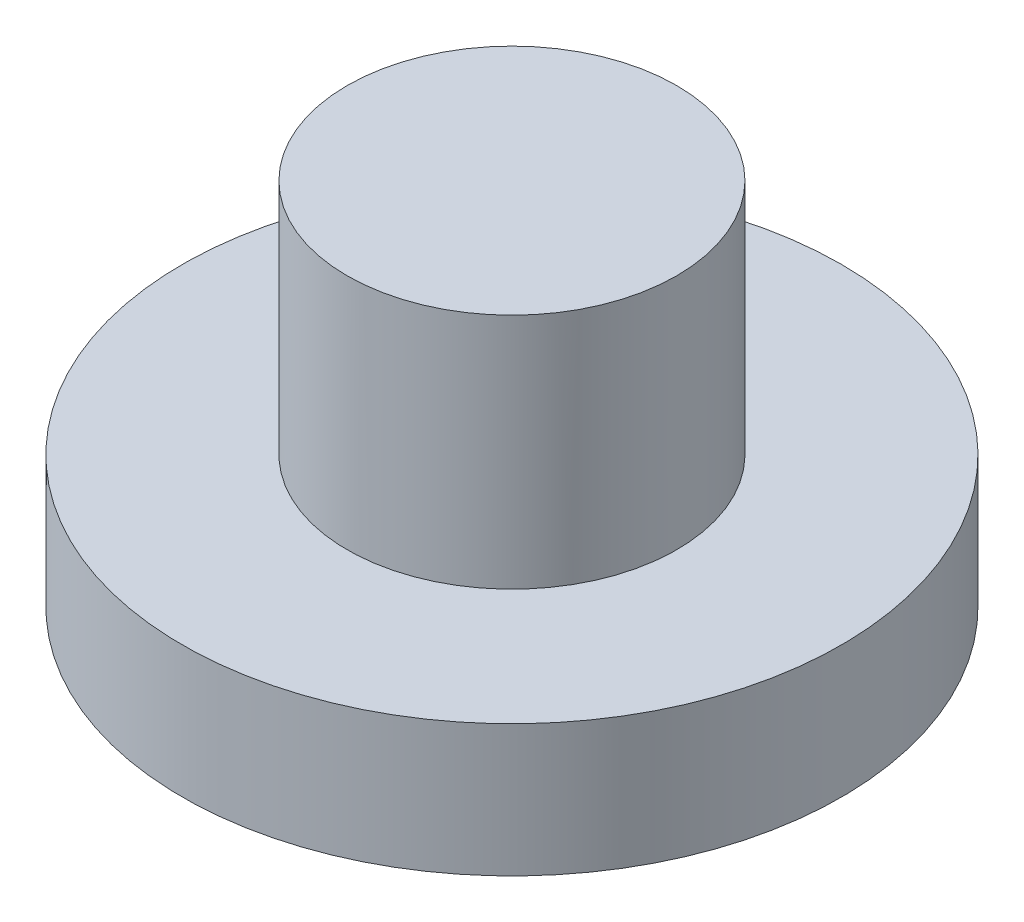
ISO-10303-21;
HEADER;
FILE_DESCRIPTION(('STEP AP214'),'2;1');
FILE_NAME('part.step','',(''),(''),'','','');
FILE_SCHEMA(('AUTOMOTIVE_DESIGN { 1 0 10303 214 1 1 1 1 }'));
ENDSEC;
DATA;
#1=APPLICATION_CONTEXT('core data for automotive mechanical design processes');
#2=APPLICATION_PROTOCOL_DEFINITION('international standard','automotive_design',2000,#1);
#3=PRODUCT_CONTEXT('',#1,'mechanical');
#4=PRODUCT('Part','Part','',(#3));
#5=PRODUCT_RELATED_PRODUCT_CATEGORY('part','',(#4));
#6=PRODUCT_DEFINITION_FORMATION('','',#4);
#7=PRODUCT_DEFINITION_CONTEXT('part definition',#1,'design');
#8=PRODUCT_DEFINITION('design','',#6,#7);
#9=PRODUCT_DEFINITION_SHAPE('','',#8);
#10=(LENGTH_UNIT() NAMED_UNIT(*) SI_UNIT(.MILLI.,.METRE.));
#11=(NAMED_UNIT(*) PLANE_ANGLE_UNIT() SI_UNIT($,.RADIAN.));
#12=(NAMED_UNIT(*) SI_UNIT($,.STERADIAN.) SOLID_ANGLE_UNIT());
#13=UNCERTAINTY_MEASURE_WITH_UNIT(LENGTH_MEASURE(1.E-05),#10,'distance_accuracy_value','');
#14=(GEOMETRIC_REPRESENTATION_CONTEXT(3) GLOBAL_UNCERTAINTY_ASSIGNED_CONTEXT((#13)) GLOBAL_UNIT_ASSIGNED_CONTEXT((#10,
#11,#12)) REPRESENTATION_CONTEXT('',''));
#15=CARTESIAN_POINT('',(0.,0.,0.));
#16=DIRECTION('',(0.,0.,1.));
#17=DIRECTION('',(1.,0.,0.));
#18=AXIS2_PLACEMENT_3D('',#15,#16,#17);
#19=CARTESIAN_POINT('',(0.,1.143,0.));
#20=DIRECTION('',(0.,-1.,0.));
#21=DIRECTION('',(0.,0.,-1.));
#22=AXIS2_PLACEMENT_3D('',#19,#20,#21);
#23=CYLINDRICAL_SURFACE('',#22,0.79375);
#24=CARTESIAN_POINT('',(0.,1.143,0.));
#25=DIRECTION('',(0.,1.,0.));
#26=DIRECTION('',(0.,0.,1.));
#27=AXIS2_PLACEMENT_3D('',#24,#25,#26);
#28=CIRCLE('',#27,0.79375);
#29=CARTESIAN_POINT('',(0.,1.143,0.79375));
#30=VERTEX_POINT('',#29);
#31=EDGE_CURVE('E10',#30,#30,#28,.T.);
#32=ORIENTED_EDGE('',*,*,#31,.F.);
#33=EDGE_LOOP('',(#32));
#34=FACE_BOUND('',#33,.T.);
#35=CARTESIAN_POINT('',(0.,0.,0.));
#36=DIRECTION('',(0.,-1.,0.));
#37=DIRECTION('',(0.,0.,-1.));
#38=AXIS2_PLACEMENT_3D('',#35,#36,#37);
#39=CIRCLE('',#38,0.79375);
#40=CARTESIAN_POINT('',(0.,0.,-0.79375));
#41=VERTEX_POINT('',#40);
#42=EDGE_CURVE('E39',#41,#41,#39,.T.);
#43=ORIENTED_EDGE('',*,*,#42,.F.);
#44=EDGE_LOOP('',(#43));
#45=FACE_BOUND('',#44,.T.);
#46=ADVANCED_FACE('F33',(#34,#45),#23,.T.);
#47=CARTESIAN_POINT('',(0.,1.143,0.));
#48=DIRECTION('',(0.,1.,0.));
#49=DIRECTION('',(0.,0.,1.));
#50=AXIS2_PLACEMENT_3D('',#47,#48,#49);
#51=PLANE('',#50);
#52=ORIENTED_EDGE('',*,*,#31,.T.);
#53=EDGE_LOOP('',(#52));
#54=FACE_BOUND('',#53,.T.);
#55=ADVANCED_FACE('F57',(#54),#51,.T.);
#56=CARTESIAN_POINT('',(0.,0.,0.));
#57=DIRECTION('',(0.,-1.,0.));
#58=DIRECTION('',(0.,0.,-1.));
#59=AXIS2_PLACEMENT_3D('',#56,#57,#58);
#60=PLANE('',#59);
#61=CARTESIAN_POINT('',(0.,0.,0.));
#62=DIRECTION('',(0.,-1.,0.));
#63=DIRECTION('',(0.,0.,-1.));
#64=AXIS2_PLACEMENT_3D('',#61,#62,#63);
#65=CIRCLE('',#64,1.5875);
#66=CARTESIAN_POINT('',(0.,0.,-1.5875));
#67=VERTEX_POINT('',#66);
#68=EDGE_CURVE('E47',#67,#67,#65,.T.);
#69=ORIENTED_EDGE('',*,*,#68,.F.);
#70=EDGE_LOOP('',(#69));
#71=FACE_BOUND('',#70,.T.);
#72=ORIENTED_EDGE('',*,*,#42,.T.);
#73=EDGE_LOOP('',(#72));
#74=FACE_BOUND('',#73,.T.);
#75=ADVANCED_FACE('F55',(#71,#74),#60,.F.);
#76=CARTESIAN_POINT('',(0.,-0.635,0.));
#77=DIRECTION('',(0.,1.,0.));
#78=DIRECTION('',(0.,0.,1.));
#79=AXIS2_PLACEMENT_3D('',#76,#77,#78);
#80=CYLINDRICAL_SURFACE('',#79,1.5875);
#81=CARTESIAN_POINT('',(0.,-0.635,0.));
#82=DIRECTION('',(0.,-1.,0.));
#83=DIRECTION('',(0.,0.,-1.));
#84=AXIS2_PLACEMENT_3D('',#81,#82,#83);
#85=CIRCLE('',#84,1.5875);
#86=CARTESIAN_POINT('',(0.,-0.635,-1.5875));
#87=VERTEX_POINT('',#86);
#88=EDGE_CURVE('E43',#87,#87,#85,.T.);
#89=ORIENTED_EDGE('',*,*,#88,.F.);
#90=EDGE_LOOP('',(#89));
#91=FACE_BOUND('',#90,.T.);
#92=ORIENTED_EDGE('',*,*,#68,.T.);
#93=EDGE_LOOP('',(#92));
#94=FACE_BOUND('',#93,.T.);
#95=ADVANCED_FACE('F53',(#91,#94),#80,.T.);
#96=CARTESIAN_POINT('',(0.,2.48179166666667,0.));
#97=DIRECTION('',(0.,1.,0.));
#98=DIRECTION('',(0.,0.,-1.));
#99=AXIS2_PLACEMENT_3D('',#96,#97,#98);
#100=SPHERICAL_SURFACE('',#99,3.49779166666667);
#101=ORIENTED_EDGE('',*,*,#88,.T.);
#102=EDGE_LOOP('',(#101));
#103=FACE_BOUND('',#102,.T.);
#104=ADVANCED_FACE('F63',(#103),#100,.T.);
#105=CLOSED_SHELL('',(#46,#55,#75,#95,#104));
#106=MANIFOLD_SOLID_BREP('B2',#105);
#107=ADVANCED_BREP_SHAPE_REPRESENTATION('',(#18,#106),#14);
#108=SHAPE_DEFINITION_REPRESENTATION(#9,#107);
ENDSEC;
END-ISO-10303-21;
